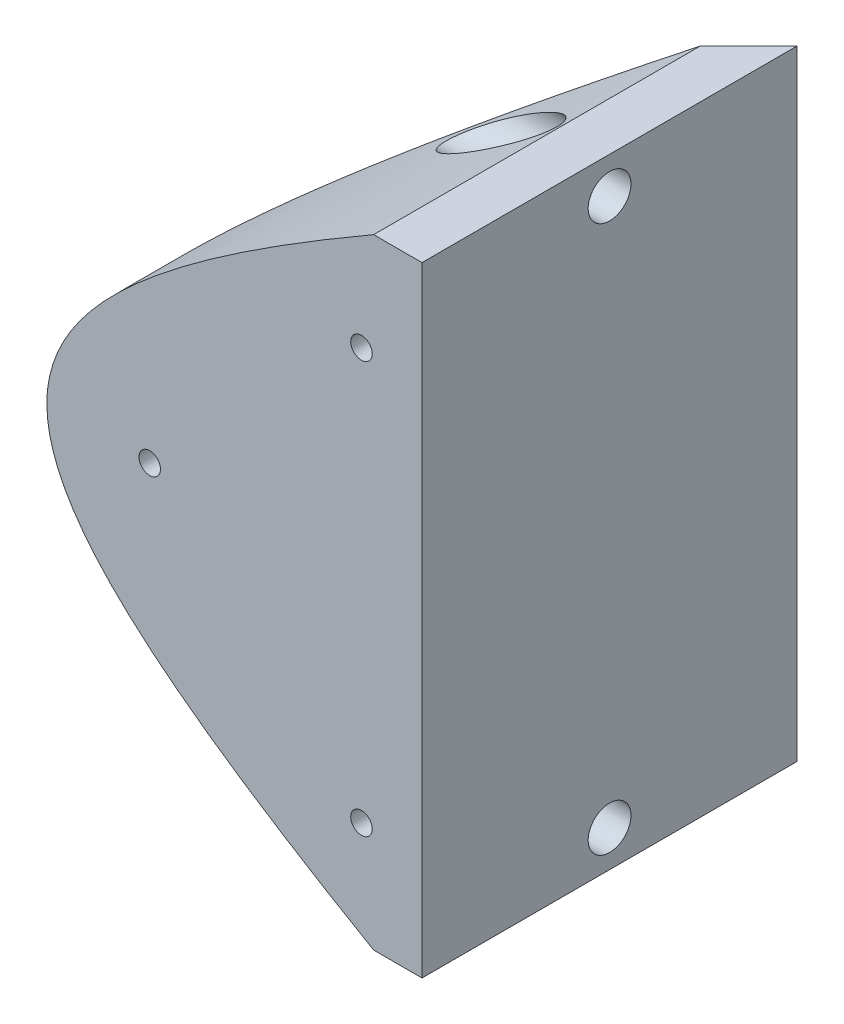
from build123d import *

# Parameters (mm, degrees)
BOSS_EXTRUDE1_DEPTH = 32.512
SKETCH2_OUTSIDE_W   = 58.49
SKETCH2_OUTSIDE_H   = 84.144
CUT_EXTRUDE1_DEPTH  = 65.474986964
CUT_EXTRUDE2_REACH  = 66.475
SKETCH3_R           = 1.1303


with BuildPart() as part:
    # Sketch1 → Boss-Extrude1 (new, symmetric)
    with BuildSketch(Plane(origin=(0, 0, 0), x_dir=(1, 0, 0), z_dir=(0, 1, 0))):
        Polygon((0, 0), (0, 39.37), (-39.37, 0), align=None)
    extrude(amount=BOSS_EXTRUDE1_DEPTH, both=True)

    # Sketch2 outside → Cut-Extrude1 (cut, through all)
    with BuildSketch(Plane.XY):
        with Locations((-19.685, 0)):
            Rectangle(SKETCH2_OUTSIDE_W, SKETCH2_OUTSIDE_H)
        with BuildLine():
            Line((-5.08, -32.512), (0, -32.512))
            Line((0, -32.512), (0, 32.512))
            Line((0, 32.512), (-5.08, 32.512))
            add(Edge.make_bspline(
                [(-5.08, 32.512), (-61.392435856, 0), (-5.08, -32.512)],
                knots=[0, 0, 0, 1, 1, 1], degree=2, weights=[1, 1.557048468, 1]))
        make_face(mode=Mode.SUBTRACT)
    extrude(amount=-CUT_EXTRUDE1_DEPTH, mode=Mode.SUBTRACT)

    # Cut-Extrude2: up to this plane
    cut_extrude2_end = Plane(origin=(0.898025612, 32.512, -38.471974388), z_dir=(0.7071067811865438, 0, 0.7071067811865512))
    # Sketch3 → Cut-Extrude2 (cut, up to the surface)
    with BuildSketch(Plane.XY, mode=Mode.PRIVATE) as cut_extrude2_sk1:
        with Locations((-6.35, 21.59)):
            Circle(SKETCH3_R)
    cut_extrude2_tool1 = split(extrude(cut_extrude2_sk1.sketch, amount=-CUT_EXTRUDE2_REACH, mode=Mode.PRIVATE), bisect_by=cut_extrude2_end, keep=Keep.BOTH, mode=Mode.PRIVATE)
    add(cut_extrude2_tool1.solids().sort_by_distance((-6.35, 21.59, 0))[0], mode=Mode.SUBTRACT)
    # Sketch3 → Cut-Extrude2 (cut, up to the surface)
    with BuildSketch(Plane.XY, mode=Mode.PRIVATE) as cut_extrude2_sk2:
        with Locations((-6.35, -21.59)):
            Circle(SKETCH3_R)
    cut_extrude2_tool2 = split(extrude(cut_extrude2_sk2.sketch, amount=-CUT_EXTRUDE2_REACH, mode=Mode.PRIVATE), bisect_by=cut_extrude2_end, keep=Keep.BOTH, mode=Mode.PRIVATE)
    add(cut_extrude2_tool2.solids().sort_by_distance((-6.35, -21.59, 0))[0], mode=Mode.SUBTRACT)
    # Sketch3 → Cut-Extrude2 (cut, up to the surface)
    with BuildSketch(Plane.XY, mode=Mode.PRIVATE) as cut_extrude2_sk3:
        with Locations((-28.575, 0)):
            Circle(SKETCH3_R)
    cut_extrude2_tool3 = split(extrude(cut_extrude2_sk3.sketch, amount=-CUT_EXTRUDE2_REACH, mode=Mode.PRIVATE), bisect_by=cut_extrude2_end, keep=Keep.BOTH, mode=Mode.PRIVATE)
    add(cut_extrude2_tool3.solids().sort_by_distance((-28.575, 0, 0))[0], mode=Mode.SUBTRACT)

    # Sketch4 → Cut-Revolve1 (revolve, cut)
    with BuildSketch(Plane.XY.offset(-19.685), mode=Mode.PRIVATE) as cut_revolve1_sk:
        Polygon((-22.031381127, 32.258), (-3.175, 32.258), (-3.175, 30.9499), (0, 30.9499), (0, 28.702), (-22.031381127, 28.702), align=None)
    cut_revolve1 = revolve(cut_revolve1_sk.sketch.rotate(Axis((-45.062753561, 28.702, -19.685), (1, 0, 0)), 90), axis=Axis((-45.062753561, 28.702, -19.685), (1, 0, 0)), mode=Mode.SUBTRACT)

    # Mirror1: Cut-Revolve1 across plane
    add(cut_revolve1.mirror(Plane.ZX), mode=Mode.SUBTRACT)


solid = part.part
